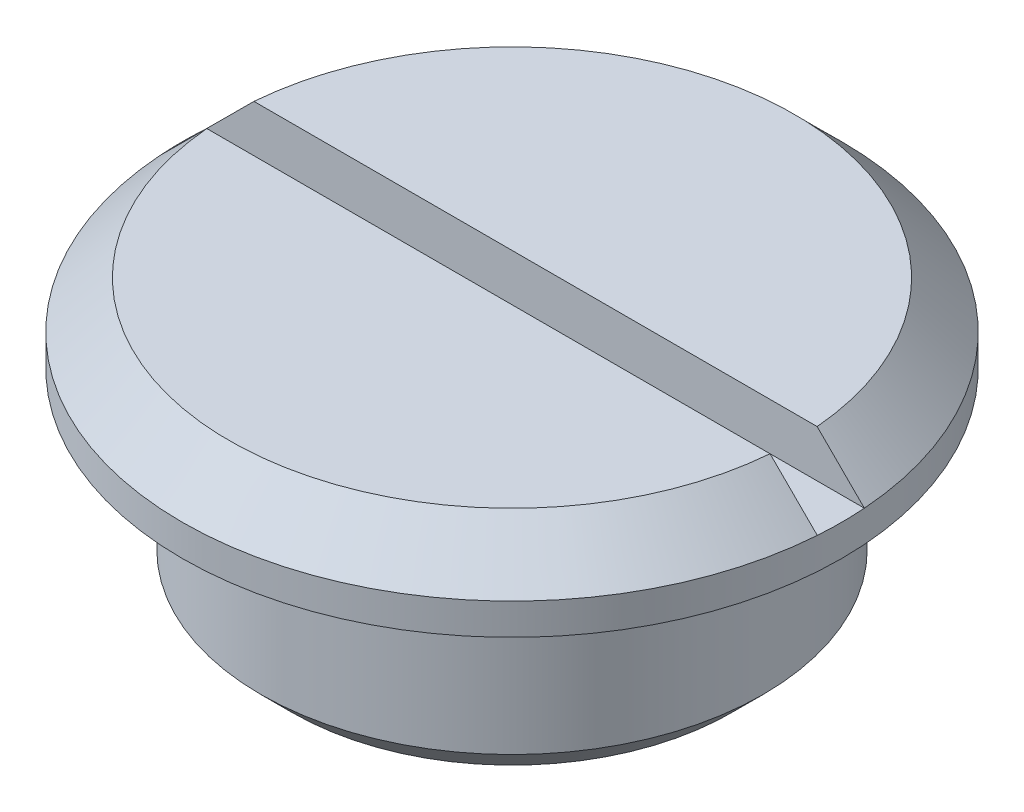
from build123d import *

# Parameters (mm, degrees)
ESQUISSE2_W             = 21
ESQUISSE2_H             = 1.5
ENL_V_MAT_EXTRU_1_DEPTH = 1.5


with BuildPart() as part:
    # Esquisse1 → Base-R_volution (revolve)
    with BuildSketch(Plane.XY, mode=Mode.PRIVATE) as base_r_volution_sk:
        Polygon((0, 0), (-7, 0), (-8, 1), (-8, 4.75), (-6.75, 4.75), (-6.75, 6), (-10.5, 6), (-10.5, 7), (-9, 8.5), (0, 8.5), align=None)
    revolve(base_r_volution_sk.sketch.rotate(Axis((0, 46, 0), (0, -1, 0)), 270), axis=Axis((0, 46, 0), (0, -1, 0)))

    # Esquisse2 → Enl_v. mat.-Extru.1 (cut)
    with BuildSketch(Plane(origin=(0, 8.5, 0), x_dir=(-1, 0, 0), z_dir=(0, 1, 0))):
        Rectangle(ESQUISSE2_W, ESQUISSE2_H)
    extrude(amount=-ENL_V_MAT_EXTRU_1_DEPTH, mode=Mode.SUBTRACT)


solid = part.part
